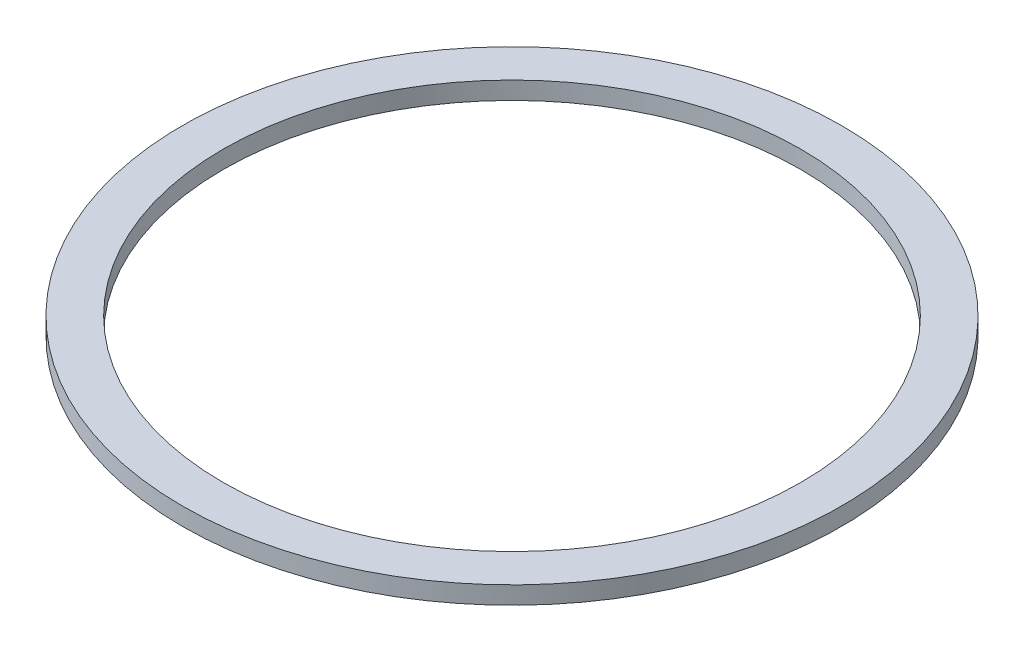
ISO-10303-21;
HEADER;
FILE_DESCRIPTION(('STEP AP214'),'2;1');
FILE_NAME('part.step','',(''),(''),'','','');
FILE_SCHEMA(('AUTOMOTIVE_DESIGN { 1 0 10303 214 1 1 1 1 }'));
ENDSEC;
DATA;
#1=APPLICATION_CONTEXT('core data for automotive mechanical design processes');
#2=APPLICATION_PROTOCOL_DEFINITION('international standard','automotive_design',2000,#1);
#3=PRODUCT_CONTEXT('',#1,'mechanical');
#4=PRODUCT('Part','Part','',(#3));
#5=PRODUCT_RELATED_PRODUCT_CATEGORY('part','',(#4));
#6=PRODUCT_DEFINITION_FORMATION('','',#4);
#7=PRODUCT_DEFINITION_CONTEXT('part definition',#1,'design');
#8=PRODUCT_DEFINITION('design','',#6,#7);
#9=PRODUCT_DEFINITION_SHAPE('','',#8);
#10=(LENGTH_UNIT() NAMED_UNIT(*) SI_UNIT(.MILLI.,.METRE.));
#11=(NAMED_UNIT(*) PLANE_ANGLE_UNIT() SI_UNIT($,.RADIAN.));
#12=(NAMED_UNIT(*) SI_UNIT($,.STERADIAN.) SOLID_ANGLE_UNIT());
#13=UNCERTAINTY_MEASURE_WITH_UNIT(LENGTH_MEASURE(1.E-05),#10,'distance_accuracy_value','');
#14=(GEOMETRIC_REPRESENTATION_CONTEXT(3) GLOBAL_UNCERTAINTY_ASSIGNED_CONTEXT((#13)) GLOBAL_UNIT_ASSIGNED_CONTEXT((#10,
#11,#12)) REPRESENTATION_CONTEXT('',''));
#15=CARTESIAN_POINT('',(0.,0.,0.));
#16=DIRECTION('',(0.,0.,1.));
#17=DIRECTION('',(1.,0.,0.));
#18=AXIS2_PLACEMENT_3D('',#15,#16,#17);
#19=CARTESIAN_POINT('',(88.773,4.7625,0.));
#20=DIRECTION('',(0.,1.,0.));
#21=DIRECTION('',(0.,0.,1.));
#22=AXIS2_PLACEMENT_3D('',#19,#20,#21);
#23=PLANE('',#22);
#24=CARTESIAN_POINT('',(0.,4.7625,0.));
#25=DIRECTION('',(0.,-1.,0.));
#26=DIRECTION('',(0.,0.,-1.));
#27=AXIS2_PLACEMENT_3D('',#24,#25,#26);
#28=CIRCLE('',#27,77.7875);
#29=CARTESIAN_POINT('',(0.,4.7625,-77.7875));
#30=VERTEX_POINT('',#29);
#31=EDGE_CURVE('E10',#30,#30,#28,.T.);
#32=ORIENTED_EDGE('',*,*,#31,.T.);
#33=EDGE_LOOP('',(#32));
#34=FACE_BOUND('',#33,.T.);
#35=CARTESIAN_POINT('',(0.,4.7625,0.));
#36=DIRECTION('',(0.,-1.,0.));
#37=DIRECTION('',(0.,0.,-1.));
#38=AXIS2_PLACEMENT_3D('',#35,#36,#37);
#39=CIRCLE('',#38,88.773);
#40=CARTESIAN_POINT('',(0.,4.7625,-88.773));
#41=VERTEX_POINT('',#40);
#42=EDGE_CURVE('E46',#41,#41,#39,.T.);
#43=ORIENTED_EDGE('',*,*,#42,.F.);
#44=EDGE_LOOP('',(#43));
#45=FACE_BOUND('',#44,.T.);
#46=ADVANCED_FACE('F32',(#34,#45),#23,.T.);
#47=CARTESIAN_POINT('',(0.,0.,0.));
#48=DIRECTION('',(0.,-1.,0.));
#49=DIRECTION('',(0.,0.,-1.));
#50=AXIS2_PLACEMENT_3D('',#47,#48,#49);
#51=CYLINDRICAL_SURFACE('',#50,77.7875);
#52=CARTESIAN_POINT('',(0.,0.,0.));
#53=DIRECTION('',(0.,-1.,0.));
#54=DIRECTION('',(0.,0.,-1.));
#55=AXIS2_PLACEMENT_3D('',#52,#53,#54);
#56=CIRCLE('',#55,77.7875);
#57=CARTESIAN_POINT('',(0.,0.,-77.7875));
#58=VERTEX_POINT('',#57);
#59=EDGE_CURVE('E38',#58,#58,#56,.T.);
#60=ORIENTED_EDGE('',*,*,#59,.T.);
#61=EDGE_LOOP('',(#60));
#62=FACE_BOUND('',#61,.T.);
#63=ORIENTED_EDGE('',*,*,#31,.F.);
#64=EDGE_LOOP('',(#63));
#65=FACE_BOUND('',#64,.T.);
#66=ADVANCED_FACE('F56',(#62,#65),#51,.F.);
#67=CARTESIAN_POINT('',(77.7875,0.,0.));
#68=DIRECTION('',(0.,-1.,0.));
#69=DIRECTION('',(0.,0.,-1.));
#70=AXIS2_PLACEMENT_3D('',#67,#68,#69);
#71=PLANE('',#70);
#72=CARTESIAN_POINT('',(0.,0.,0.));
#73=DIRECTION('',(0.,-1.,0.));
#74=DIRECTION('',(0.,0.,-1.));
#75=AXIS2_PLACEMENT_3D('',#72,#73,#74);
#76=CIRCLE('',#75,88.773);
#77=CARTESIAN_POINT('',(0.,0.,-88.773));
#78=VERTEX_POINT('',#77);
#79=EDGE_CURVE('E42',#78,#78,#76,.T.);
#80=ORIENTED_EDGE('',*,*,#79,.T.);
#81=EDGE_LOOP('',(#80));
#82=FACE_BOUND('',#81,.T.);
#83=ORIENTED_EDGE('',*,*,#59,.F.);
#84=EDGE_LOOP('',(#83));
#85=FACE_BOUND('',#84,.T.);
#86=ADVANCED_FACE('F60',(#82,#85),#71,.T.);
#87=CARTESIAN_POINT('',(0.,0.,0.));
#88=DIRECTION('',(0.,-1.,0.));
#89=DIRECTION('',(0.,0.,-1.));
#90=AXIS2_PLACEMENT_3D('',#87,#88,#89);
#91=CYLINDRICAL_SURFACE('',#90,88.773);
#92=ORIENTED_EDGE('',*,*,#42,.T.);
#93=EDGE_LOOP('',(#92));
#94=FACE_BOUND('',#93,.T.);
#95=ORIENTED_EDGE('',*,*,#79,.F.);
#96=EDGE_LOOP('',(#95));
#97=FACE_BOUND('',#96,.T.);
#98=ADVANCED_FACE('F52',(#94,#97),#91,.T.);
#99=CLOSED_SHELL('',(#46,#66,#86,#98));
#100=MANIFOLD_SOLID_BREP('B2',#99);
#101=ADVANCED_BREP_SHAPE_REPRESENTATION('',(#18,#100),#14);
#102=SHAPE_DEFINITION_REPRESENTATION(#9,#101);
ENDSEC;
END-ISO-10303-21;
